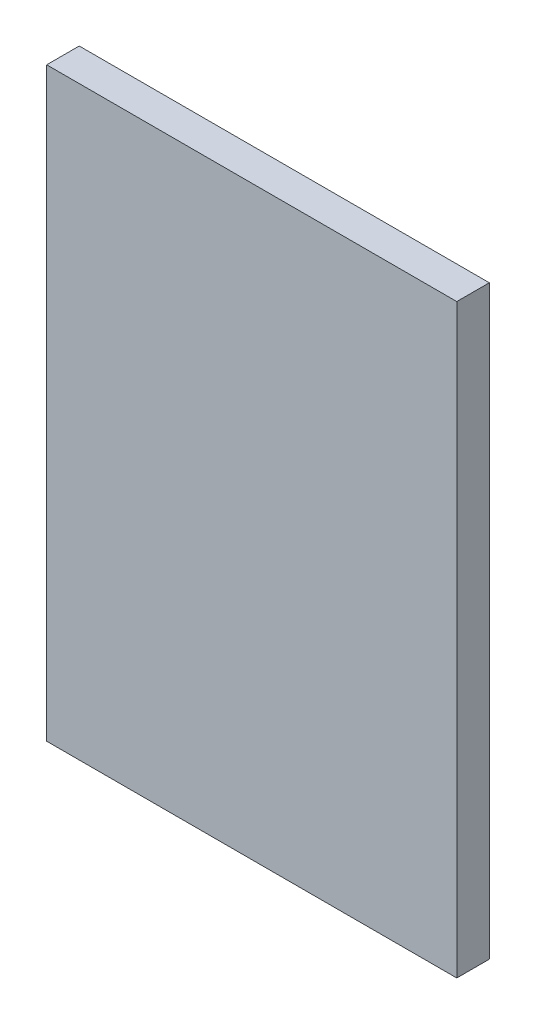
from build123d import *

# Parameters (mm, degrees)
ESQUISSE1_W        = 1260
ESQUISSE1_H        = 1800
BOSS_EXTRU_1_DEPTH = 100


with BuildPart() as part:
    # Esquisse1 → Boss.-Extru.1 (new body)
    with BuildSketch(Plane.XY):
        with Locations((-630, 900)):
            Rectangle(ESQUISSE1_W, ESQUISSE1_H)
    extrude(amount=-BOSS_EXTRU_1_DEPTH)


solid = part.part
